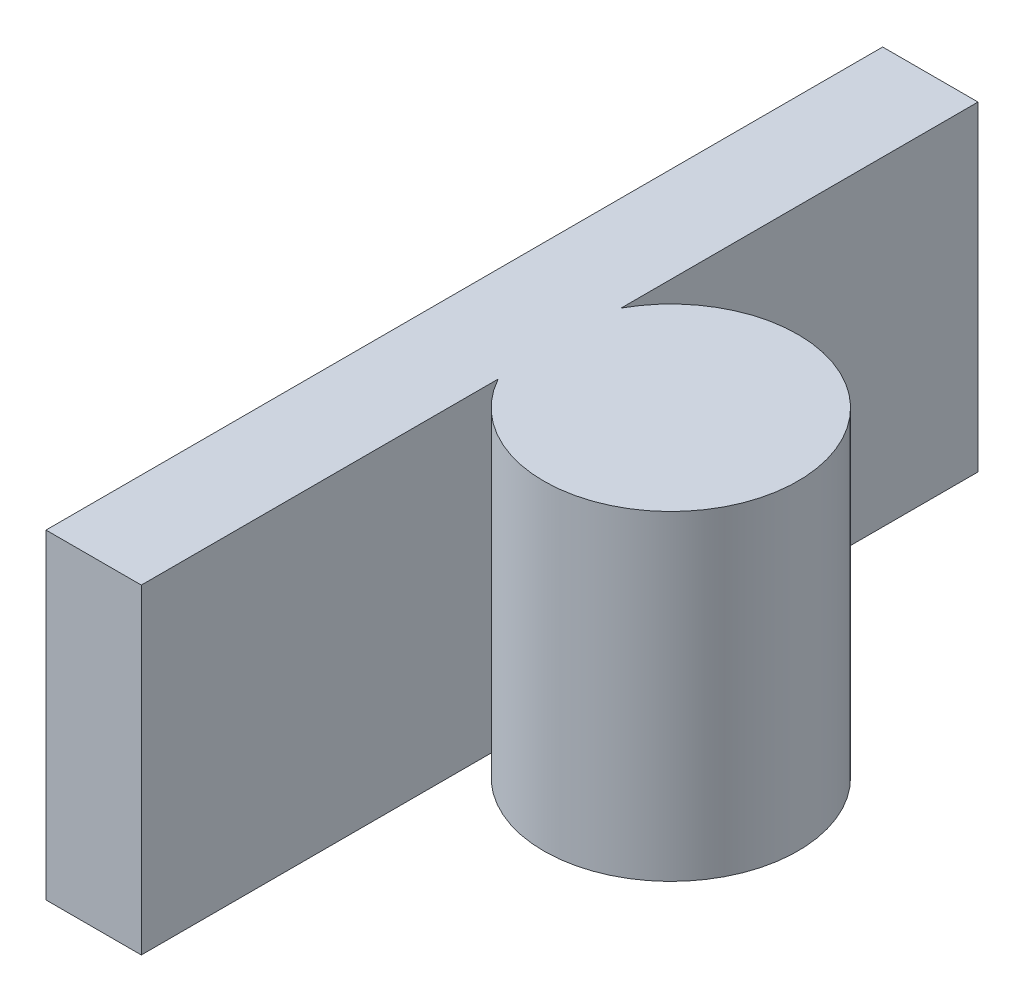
from build123d import *

# Parameters (mm, degrees)
BOSS_EXTRU_1_DEPTH = 12.1


with BuildPart() as part:
    # Esquisse1 → Boss.-Extru.1 (new body)
    with BuildSketch(Plane(origin=(0, 0, 0), x_dir=(1, 0, 0), z_dir=(0, 1, 0))):
        with BuildLine():
            Line((27.244540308, -6.09940596), (27.244540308, -19.575615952))
            Line((27.244540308, -19.575615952), (23.644540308, -19.575615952))
            Line((23.644540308, -19.575615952), (23.644540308, 12.024384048))
            Line((23.644540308, 12.024384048), (27.244540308, 12.024384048))
            Line((27.244540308, 12.024384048), (27.244540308, -1.451825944))
            ThreePointArc((27.244540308, -1.451825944), (36.244540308, -3.775615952), (27.244540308, -6.09940596))
        make_face()
    extrude(amount=BOSS_EXTRU_1_DEPTH)


solid = part.part
